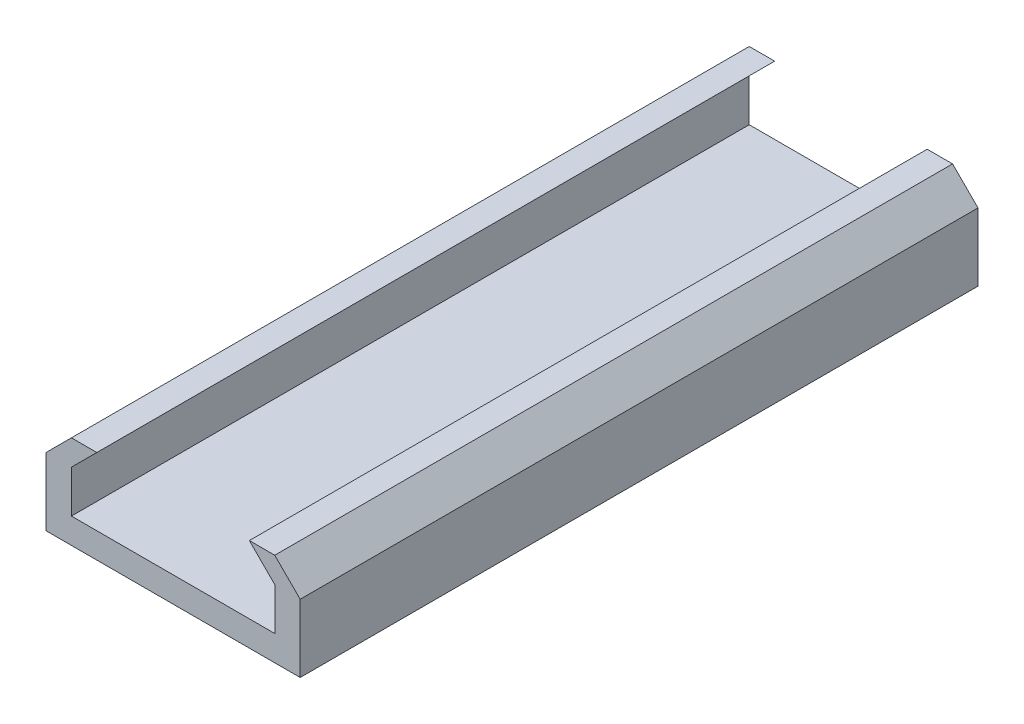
ISO-10303-21;
HEADER;
FILE_DESCRIPTION(('STEP AP214'),'2;1');
FILE_NAME('part.step','',(''),(''),'','','');
FILE_SCHEMA(('AUTOMOTIVE_DESIGN { 1 0 10303 214 1 1 1 1 }'));
ENDSEC;
DATA;
#1=APPLICATION_CONTEXT('core data for automotive mechanical design processes');
#2=APPLICATION_PROTOCOL_DEFINITION('international standard','automotive_design',2000,#1);
#3=PRODUCT_CONTEXT('',#1,'mechanical');
#4=PRODUCT('Part','Part','',(#3));
#5=PRODUCT_RELATED_PRODUCT_CATEGORY('part','',(#4));
#6=PRODUCT_DEFINITION_FORMATION('','',#4);
#7=PRODUCT_DEFINITION_CONTEXT('part definition',#1,'design');
#8=PRODUCT_DEFINITION('design','',#6,#7);
#9=PRODUCT_DEFINITION_SHAPE('','',#8);
#10=(LENGTH_UNIT() NAMED_UNIT(*) SI_UNIT(.MILLI.,.METRE.));
#11=(NAMED_UNIT(*) PLANE_ANGLE_UNIT() SI_UNIT($,.RADIAN.));
#12=(NAMED_UNIT(*) SI_UNIT($,.STERADIAN.) SOLID_ANGLE_UNIT());
#13=UNCERTAINTY_MEASURE_WITH_UNIT(LENGTH_MEASURE(1.E-05),#10,'distance_accuracy_value','');
#14=(GEOMETRIC_REPRESENTATION_CONTEXT(3) GLOBAL_UNCERTAINTY_ASSIGNED_CONTEXT((#13)) GLOBAL_UNIT_ASSIGNED_CONTEXT((#10,
#11,#12)) REPRESENTATION_CONTEXT('',''));
#15=CARTESIAN_POINT('',(0.,0.,0.));
#16=DIRECTION('',(0.,0.,1.));
#17=DIRECTION('',(1.,0.,0.));
#18=AXIS2_PLACEMENT_3D('',#15,#16,#17);
#19=CARTESIAN_POINT('',(-47.625,-9.525,-254.));
#20=DIRECTION('',(-1.,0.,0.));
#21=DIRECTION('',(0.,-1.,0.));
#22=AXIS2_PLACEMENT_3D('',#19,#20,#21);
#23=PLANE('',#22);
#24=DIRECTION('',(0.,-1.,0.));
#25=VECTOR('',#24,1.);
#26=CARTESIAN_POINT('',(-47.625,-9.525,0.));
#27=LINE('',#26,#25);
#28=CARTESIAN_POINT('',(-47.625,15.875,0.));
#29=VERTEX_POINT('',#28);
#30=CARTESIAN_POINT('',(-47.625,-9.525,0.));
#31=VERTEX_POINT('',#30);
#32=EDGE_CURVE('E153',#29,#31,#27,.T.);
#33=ORIENTED_EDGE('',*,*,#32,.F.);
#34=DIRECTION('',(0.,0.,1.));
#35=VECTOR('',#34,1.);
#36=CARTESIAN_POINT('',(-47.625,15.875,-254.));
#37=LINE('',#36,#35);
#38=CARTESIAN_POINT('',(-47.625,15.875,-254.));
#39=VERTEX_POINT('',#38);
#40=EDGE_CURVE('E11',#39,#29,#37,.T.);
#41=ORIENTED_EDGE('',*,*,#40,.F.);
#42=DIRECTION('',(0.,-1.,0.));
#43=VECTOR('',#42,1.);
#44=CARTESIAN_POINT('',(-47.625,-9.525,-254.));
#45=LINE('',#44,#43);
#46=CARTESIAN_POINT('',(-47.625,-9.525,-254.));
#47=VERTEX_POINT('',#46);
#48=EDGE_CURVE('E185',#39,#47,#45,.T.);
#49=ORIENTED_EDGE('',*,*,#48,.T.);
#50=DIRECTION('',(0.,0.,1.));
#51=VECTOR('',#50,1.);
#52=CARTESIAN_POINT('',(-47.625,-9.525,-254.));
#53=LINE('',#52,#51);
#54=EDGE_CURVE('E35',#47,#31,#53,.T.);
#55=ORIENTED_EDGE('',*,*,#54,.T.);
#56=EDGE_LOOP('',(#33,#41,#49,#55));
#57=FACE_BOUND('',#56,.T.);
#58=ADVANCED_FACE('F32',(#57),#23,.T.);
#59=CARTESIAN_POINT('',(-47.625,15.875,-254.));
#60=DIRECTION('',(-0.707106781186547,0.707106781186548,0.));
#61=DIRECTION('',(-0.707106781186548,-0.707106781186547,0.));
#62=AXIS2_PLACEMENT_3D('',#59,#60,#61);
#63=PLANE('',#62);
#64=DIRECTION('',(-0.707106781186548,-0.707106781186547,0.));
#65=VECTOR('',#64,1.);
#66=CARTESIAN_POINT('',(-47.625,15.875,0.));
#67=LINE('',#66,#65);
#68=CARTESIAN_POINT('',(-38.1,25.4,0.));
#69=VERTEX_POINT('',#68);
#70=EDGE_CURVE('E183',#69,#29,#67,.T.);
#71=ORIENTED_EDGE('',*,*,#70,.F.);
#72=DIRECTION('',(0.,0.,1.));
#73=VECTOR('',#72,1.);
#74=CARTESIAN_POINT('',(-38.1,25.4,-254.));
#75=LINE('',#74,#73);
#76=CARTESIAN_POINT('',(-38.1,25.4,-254.));
#77=VERTEX_POINT('',#76);
#78=EDGE_CURVE('E41',#77,#69,#75,.T.);
#79=ORIENTED_EDGE('',*,*,#78,.F.);
#80=DIRECTION('',(-0.707106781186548,-0.707106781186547,0.));
#81=VECTOR('',#80,1.);
#82=CARTESIAN_POINT('',(-47.625,15.875,-254.));
#83=LINE('',#82,#81);
#84=EDGE_CURVE('E143',#77,#39,#83,.T.);
#85=ORIENTED_EDGE('',*,*,#84,.T.);
#86=ORIENTED_EDGE('',*,*,#40,.T.);
#87=EDGE_LOOP('',(#71,#79,#85,#86));
#88=FACE_BOUND('',#87,.T.);
#89=ADVANCED_FACE('F205',(#88),#63,.T.);
#90=CARTESIAN_POINT('',(-38.1,25.4,-254.));
#91=DIRECTION('',(0.,1.,0.));
#92=DIRECTION('',(0.,0.,1.));
#93=AXIS2_PLACEMENT_3D('',#90,#91,#92);
#94=PLANE('',#93);
#95=DIRECTION('',(-1.,0.,0.));
#96=VECTOR('',#95,1.);
#97=CARTESIAN_POINT('',(-38.1,25.4,0.));
#98=LINE('',#97,#96);
#99=CARTESIAN_POINT('',(-28.575,25.4,0.));
#100=VERTEX_POINT('',#99);
#101=EDGE_CURVE('E130',#100,#69,#98,.T.);
#102=ORIENTED_EDGE('',*,*,#101,.F.);
#103=DIRECTION('',(0.,0.,1.));
#104=VECTOR('',#103,1.);
#105=CARTESIAN_POINT('',(-28.575,25.4,-254.));
#106=LINE('',#105,#104);
#107=CARTESIAN_POINT('',(-28.575,25.4,-254.));
#108=VERTEX_POINT('',#107);
#109=EDGE_CURVE('E125',#108,#100,#106,.T.);
#110=ORIENTED_EDGE('',*,*,#109,.F.);
#111=DIRECTION('',(-1.,0.,0.));
#112=VECTOR('',#111,1.);
#113=CARTESIAN_POINT('',(-38.1,25.4,-254.));
#114=LINE('',#113,#112);
#115=EDGE_CURVE('E128',#108,#77,#114,.T.);
#116=ORIENTED_EDGE('',*,*,#115,.T.);
#117=ORIENTED_EDGE('',*,*,#78,.T.);
#118=EDGE_LOOP('',(#102,#110,#116,#117));
#119=FACE_BOUND('',#118,.T.);
#120=ADVANCED_FACE('F127',(#119),#94,.T.);
#121=CARTESIAN_POINT('',(-28.575,25.4,-254.));
#122=DIRECTION('',(0.707106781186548,-0.707106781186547,0.));
#123=DIRECTION('',(0.707106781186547,0.707106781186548,0.));
#124=AXIS2_PLACEMENT_3D('',#121,#122,#123);
#125=PLANE('',#124);
#126=DIRECTION('',(0.707106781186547,0.707106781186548,0.));
#127=VECTOR('',#126,1.);
#128=CARTESIAN_POINT('',(-28.575,25.4,0.));
#129=LINE('',#128,#127);
#130=CARTESIAN_POINT('',(-38.1,15.875,0.));
#131=VERTEX_POINT('',#130);
#132=EDGE_CURVE('E180',#131,#100,#129,.T.);
#133=ORIENTED_EDGE('',*,*,#132,.F.);
#134=DIRECTION('',(0.,0.,1.));
#135=VECTOR('',#134,1.);
#136=CARTESIAN_POINT('',(-38.1,15.875,-254.));
#137=LINE('',#136,#135);
#138=CARTESIAN_POINT('',(-38.1,15.875,-254.));
#139=VERTEX_POINT('',#138);
#140=EDGE_CURVE('E135',#139,#131,#137,.T.);
#141=ORIENTED_EDGE('',*,*,#140,.F.);
#142=DIRECTION('',(0.707106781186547,0.707106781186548,0.));
#143=VECTOR('',#142,1.);
#144=CARTESIAN_POINT('',(-28.575,25.4,-254.));
#145=LINE('',#144,#143);
#146=EDGE_CURVE('E141',#139,#108,#145,.T.);
#147=ORIENTED_EDGE('',*,*,#146,.T.);
#148=ORIENTED_EDGE('',*,*,#109,.T.);
#149=EDGE_LOOP('',(#133,#141,#147,#148));
#150=FACE_BOUND('',#149,.T.);
#151=ADVANCED_FACE('F145',(#150),#125,.T.);
#152=CARTESIAN_POINT('',(-38.1,15.875,-254.));
#153=DIRECTION('',(1.,0.,0.));
#154=DIRECTION('',(0.,1.,0.));
#155=AXIS2_PLACEMENT_3D('',#152,#153,#154);
#156=PLANE('',#155);
#157=DIRECTION('',(0.,1.,0.));
#158=VECTOR('',#157,1.);
#159=CARTESIAN_POINT('',(-38.1,15.875,0.));
#160=LINE('',#159,#158);
#161=CARTESIAN_POINT('',(-38.1,0.,0.));
#162=VERTEX_POINT('',#161);
#163=EDGE_CURVE('E177',#162,#131,#160,.T.);
#164=ORIENTED_EDGE('',*,*,#163,.F.);
#165=DIRECTION('',(0.,0.,1.));
#166=VECTOR('',#165,1.);
#167=CARTESIAN_POINT('',(-38.1,0.,-254.));
#168=LINE('',#167,#166);
#169=CARTESIAN_POINT('',(-38.1,0.,-254.));
#170=VERTEX_POINT('',#169);
#171=EDGE_CURVE('E189',#170,#162,#168,.T.);
#172=ORIENTED_EDGE('',*,*,#171,.F.);
#173=DIRECTION('',(0.,1.,0.));
#174=VECTOR('',#173,1.);
#175=CARTESIAN_POINT('',(-38.1,15.875,-254.));
#176=LINE('',#175,#174);
#177=EDGE_CURVE('E146',#170,#139,#176,.T.);
#178=ORIENTED_EDGE('',*,*,#177,.T.);
#179=ORIENTED_EDGE('',*,*,#140,.T.);
#180=EDGE_LOOP('',(#164,#172,#178,#179));
#181=FACE_BOUND('',#180,.T.);
#182=ADVANCED_FACE('F218',(#181),#156,.T.);
#183=CARTESIAN_POINT('',(-38.1,0.,-254.));
#184=DIRECTION('',(0.,1.,0.));
#185=DIRECTION('',(0.,0.,1.));
#186=AXIS2_PLACEMENT_3D('',#183,#184,#185);
#187=PLANE('',#186);
#188=DIRECTION('',(-1.,0.,0.));
#189=VECTOR('',#188,1.);
#190=CARTESIAN_POINT('',(-38.1,0.,0.));
#191=LINE('',#190,#189);
#192=CARTESIAN_POINT('',(38.1,0.,0.));
#193=VERTEX_POINT('',#192);
#194=EDGE_CURVE('E174',#193,#162,#191,.T.);
#195=ORIENTED_EDGE('',*,*,#194,.F.);
#196=DIRECTION('',(0.,0.,1.));
#197=VECTOR('',#196,1.);
#198=CARTESIAN_POINT('',(38.1,0.,-254.));
#199=LINE('',#198,#197);
#200=CARTESIAN_POINT('',(38.1,0.,-254.));
#201=VERTEX_POINT('',#200);
#202=EDGE_CURVE('E191',#201,#193,#199,.T.);
#203=ORIENTED_EDGE('',*,*,#202,.F.);
#204=DIRECTION('',(-1.,0.,0.));
#205=VECTOR('',#204,1.);
#206=CARTESIAN_POINT('',(-38.1,0.,-254.));
#207=LINE('',#206,#205);
#208=EDGE_CURVE('E148',#201,#170,#207,.T.);
#209=ORIENTED_EDGE('',*,*,#208,.T.);
#210=ORIENTED_EDGE('',*,*,#171,.T.);
#211=EDGE_LOOP('',(#195,#203,#209,#210));
#212=FACE_BOUND('',#211,.T.);
#213=ADVANCED_FACE('F221',(#212),#187,.T.);
#214=CARTESIAN_POINT('',(38.1,0.,-254.));
#215=DIRECTION('',(-1.,0.,0.));
#216=DIRECTION('',(0.,-1.,0.));
#217=AXIS2_PLACEMENT_3D('',#214,#215,#216);
#218=PLANE('',#217);
#219=DIRECTION('',(0.,-1.,0.));
#220=VECTOR('',#219,1.);
#221=CARTESIAN_POINT('',(38.1,0.,0.));
#222=LINE('',#221,#220);
#223=CARTESIAN_POINT('',(38.1,15.875,0.));
#224=VERTEX_POINT('',#223);
#225=EDGE_CURVE('E171',#224,#193,#222,.T.);
#226=ORIENTED_EDGE('',*,*,#225,.F.);
#227=DIRECTION('',(0.,0.,1.));
#228=VECTOR('',#227,1.);
#229=CARTESIAN_POINT('',(38.1,15.875,-254.));
#230=LINE('',#229,#228);
#231=CARTESIAN_POINT('',(38.1,15.875,-254.));
#232=VERTEX_POINT('',#231);
#233=EDGE_CURVE('E193',#232,#224,#230,.T.);
#234=ORIENTED_EDGE('',*,*,#233,.F.);
#235=DIRECTION('',(0.,-1.,0.));
#236=VECTOR('',#235,1.);
#237=CARTESIAN_POINT('',(38.1,0.,-254.));
#238=LINE('',#237,#236);
#239=EDGE_CURVE('E347',#232,#201,#238,.T.);
#240=ORIENTED_EDGE('',*,*,#239,.T.);
#241=ORIENTED_EDGE('',*,*,#202,.T.);
#242=EDGE_LOOP('',(#226,#234,#240,#241));
#243=FACE_BOUND('',#242,.T.);
#244=ADVANCED_FACE('F225',(#243),#218,.T.);
#245=CARTESIAN_POINT('',(38.1,15.875,-254.));
#246=DIRECTION('',(-0.707106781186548,-0.707106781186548,0.));
#247=DIRECTION('',(0.707106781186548,-0.707106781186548,0.));
#248=AXIS2_PLACEMENT_3D('',#245,#246,#247);
#249=PLANE('',#248);
#250=DIRECTION('',(0.707106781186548,-0.707106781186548,0.));
#251=VECTOR('',#250,1.);
#252=CARTESIAN_POINT('',(38.1,15.875,0.));
#253=LINE('',#252,#251);
#254=CARTESIAN_POINT('',(28.575,25.4,0.));
#255=VERTEX_POINT('',#254);
#256=EDGE_CURVE('E168',#255,#224,#253,.T.);
#257=ORIENTED_EDGE('',*,*,#256,.F.);
#258=DIRECTION('',(0.,0.,1.));
#259=VECTOR('',#258,1.);
#260=CARTESIAN_POINT('',(28.575,25.4,-254.));
#261=LINE('',#260,#259);
#262=CARTESIAN_POINT('',(28.575,25.4,-254.));
#263=VERTEX_POINT('',#262);
#264=EDGE_CURVE('E195',#263,#255,#261,.T.);
#265=ORIENTED_EDGE('',*,*,#264,.F.);
#266=DIRECTION('',(0.707106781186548,-0.707106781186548,0.));
#267=VECTOR('',#266,1.);
#268=CARTESIAN_POINT('',(38.1,15.875,-254.));
#269=LINE('',#268,#267);
#270=EDGE_CURVE('E351',#263,#232,#269,.T.);
#271=ORIENTED_EDGE('',*,*,#270,.T.);
#272=ORIENTED_EDGE('',*,*,#233,.T.);
#273=EDGE_LOOP('',(#257,#265,#271,#272));
#274=FACE_BOUND('',#273,.T.);
#275=ADVANCED_FACE('F229',(#274),#249,.T.);
#276=CARTESIAN_POINT('',(28.575,25.4,-254.));
#277=DIRECTION('',(0.,1.,0.));
#278=DIRECTION('',(0.,0.,1.));
#279=AXIS2_PLACEMENT_3D('',#276,#277,#278);
#280=PLANE('',#279);
#281=DIRECTION('',(-1.,0.,0.));
#282=VECTOR('',#281,1.);
#283=CARTESIAN_POINT('',(28.575,25.4,0.));
#284=LINE('',#283,#282);
#285=CARTESIAN_POINT('',(38.1,25.4,0.));
#286=VERTEX_POINT('',#285);
#287=EDGE_CURVE('E165',#286,#255,#284,.T.);
#288=ORIENTED_EDGE('',*,*,#287,.F.);
#289=DIRECTION('',(0.,0.,1.));
#290=VECTOR('',#289,1.);
#291=CARTESIAN_POINT('',(38.1,25.4,-254.));
#292=LINE('',#291,#290);
#293=CARTESIAN_POINT('',(38.1,25.4,-254.));
#294=VERTEX_POINT('',#293);
#295=EDGE_CURVE('E197',#294,#286,#292,.T.);
#296=ORIENTED_EDGE('',*,*,#295,.F.);
#297=DIRECTION('',(-1.,0.,0.));
#298=VECTOR('',#297,1.);
#299=CARTESIAN_POINT('',(28.575,25.4,-254.));
#300=LINE('',#299,#298);
#301=EDGE_CURVE('E340',#294,#263,#300,.T.);
#302=ORIENTED_EDGE('',*,*,#301,.T.);
#303=ORIENTED_EDGE('',*,*,#264,.T.);
#304=EDGE_LOOP('',(#288,#296,#302,#303));
#305=FACE_BOUND('',#304,.T.);
#306=ADVANCED_FACE('F233',(#305),#280,.T.);
#307=CARTESIAN_POINT('',(38.1,25.4,-254.));
#308=DIRECTION('',(0.707106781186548,0.707106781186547,0.));
#309=DIRECTION('',(-0.707106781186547,0.707106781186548,0.));
#310=AXIS2_PLACEMENT_3D('',#307,#308,#309);
#311=PLANE('',#310);
#312=DIRECTION('',(-0.707106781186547,0.707106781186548,0.));
#313=VECTOR('',#312,1.);
#314=CARTESIAN_POINT('',(38.1,25.4,0.));
#315=LINE('',#314,#313);
#316=CARTESIAN_POINT('',(47.625,15.875,0.));
#317=VERTEX_POINT('',#316);
#318=EDGE_CURVE('E162',#317,#286,#315,.T.);
#319=ORIENTED_EDGE('',*,*,#318,.F.);
#320=DIRECTION('',(0.,0.,1.));
#321=VECTOR('',#320,1.);
#322=CARTESIAN_POINT('',(47.625,15.875,-254.));
#323=LINE('',#322,#321);
#324=CARTESIAN_POINT('',(47.625,15.875,-254.));
#325=VERTEX_POINT('',#324);
#326=EDGE_CURVE('E199',#325,#317,#323,.T.);
#327=ORIENTED_EDGE('',*,*,#326,.F.);
#328=DIRECTION('',(-0.707106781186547,0.707106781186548,0.));
#329=VECTOR('',#328,1.);
#330=CARTESIAN_POINT('',(38.1,25.4,-254.));
#331=LINE('',#330,#329);
#332=EDGE_CURVE('E336',#325,#294,#331,.T.);
#333=ORIENTED_EDGE('',*,*,#332,.T.);
#334=ORIENTED_EDGE('',*,*,#295,.T.);
#335=EDGE_LOOP('',(#319,#327,#333,#334));
#336=FACE_BOUND('',#335,.T.);
#337=ADVANCED_FACE('F237',(#336),#311,.T.);
#338=CARTESIAN_POINT('',(47.625,-9.525,-254.));
#339=DIRECTION('',(1.,0.,0.));
#340=DIRECTION('',(0.,0.,-1.));
#341=AXIS2_PLACEMENT_3D('',#338,#339,#340);
#342=PLANE('',#341);
#343=DIRECTION('',(0.,1.,0.));
#344=VECTOR('',#343,1.);
#345=CARTESIAN_POINT('',(47.625,-9.525,0.));
#346=LINE('',#345,#344);
#347=CARTESIAN_POINT('',(47.625,-9.525,0.));
#348=VERTEX_POINT('',#347);
#349=EDGE_CURVE('E159',#348,#317,#346,.T.);
#350=ORIENTED_EDGE('',*,*,#349,.F.);
#351=DIRECTION('',(0.,0.,1.));
#352=VECTOR('',#351,1.);
#353=CARTESIAN_POINT('',(47.625,-9.525,-254.));
#354=LINE('',#353,#352);
#355=CARTESIAN_POINT('',(47.625,-9.525,-254.));
#356=VERTEX_POINT('',#355);
#357=EDGE_CURVE('E200',#356,#348,#354,.T.);
#358=ORIENTED_EDGE('',*,*,#357,.F.);
#359=DIRECTION('',(0.,1.,0.));
#360=VECTOR('',#359,1.);
#361=CARTESIAN_POINT('',(47.625,-9.525,-254.));
#362=LINE('',#361,#360);
#363=EDGE_CURVE('E357',#356,#325,#362,.T.);
#364=ORIENTED_EDGE('',*,*,#363,.T.);
#365=ORIENTED_EDGE('',*,*,#326,.T.);
#366=EDGE_LOOP('',(#350,#358,#364,#365));
#367=FACE_BOUND('',#366,.T.);
#368=ADVANCED_FACE('F241',(#367),#342,.T.);
#369=CARTESIAN_POINT('',(-47.625,-9.525,-254.));
#370=DIRECTION('',(0.,-1.,0.));
#371=DIRECTION('',(1.,0.,0.));
#372=AXIS2_PLACEMENT_3D('',#369,#370,#371);
#373=PLANE('',#372);
#374=DIRECTION('',(1.,0.,0.));
#375=VECTOR('',#374,1.);
#376=CARTESIAN_POINT('',(-47.625,-9.525,0.));
#377=LINE('',#376,#375);
#378=EDGE_CURVE('E156',#31,#348,#377,.T.);
#379=ORIENTED_EDGE('',*,*,#378,.F.);
#380=ORIENTED_EDGE('',*,*,#54,.F.);
#381=DIRECTION('',(1.,0.,0.));
#382=VECTOR('',#381,1.);
#383=CARTESIAN_POINT('',(-47.625,-9.525,-254.));
#384=LINE('',#383,#382);
#385=EDGE_CURVE('E359',#47,#356,#384,.T.);
#386=ORIENTED_EDGE('',*,*,#385,.T.);
#387=ORIENTED_EDGE('',*,*,#357,.T.);
#388=EDGE_LOOP('',(#379,#380,#386,#387));
#389=FACE_BOUND('',#388,.T.);
#390=ADVANCED_FACE('F202',(#389),#373,.T.);
#391=CARTESIAN_POINT('',(-47.625,0.,-254.));
#392=DIRECTION('',(0.,0.,-1.));
#393=DIRECTION('',(-1.,0.,0.));
#394=AXIS2_PLACEMENT_3D('',#391,#392,#393);
#395=PLANE('',#394);
#396=ORIENTED_EDGE('',*,*,#48,.F.);
#397=ORIENTED_EDGE('',*,*,#84,.F.);
#398=ORIENTED_EDGE('',*,*,#115,.F.);
#399=ORIENTED_EDGE('',*,*,#146,.F.);
#400=ORIENTED_EDGE('',*,*,#177,.F.);
#401=ORIENTED_EDGE('',*,*,#208,.F.);
#402=ORIENTED_EDGE('',*,*,#239,.F.);
#403=ORIENTED_EDGE('',*,*,#270,.F.);
#404=ORIENTED_EDGE('',*,*,#301,.F.);
#405=ORIENTED_EDGE('',*,*,#332,.F.);
#406=ORIENTED_EDGE('',*,*,#363,.F.);
#407=ORIENTED_EDGE('',*,*,#385,.F.);
#408=EDGE_LOOP('',(#396,#397,#398,#399,#400,#401,#402,#403,#404,#405,#406,#407));
#409=FACE_BOUND('',#408,.T.);
#410=ADVANCED_FACE('F139',(#409),#395,.T.);
#411=CARTESIAN_POINT('',(-47.625,0.,0.));
#412=DIRECTION('',(0.,0.,-1.));
#413=DIRECTION('',(-1.,0.,0.));
#414=AXIS2_PLACEMENT_3D('',#411,#412,#413);
#415=PLANE('',#414);
#416=ORIENTED_EDGE('',*,*,#32,.T.);
#417=ORIENTED_EDGE('',*,*,#378,.T.);
#418=ORIENTED_EDGE('',*,*,#349,.T.);
#419=ORIENTED_EDGE('',*,*,#318,.T.);
#420=ORIENTED_EDGE('',*,*,#287,.T.);
#421=ORIENTED_EDGE('',*,*,#256,.T.);
#422=ORIENTED_EDGE('',*,*,#225,.T.);
#423=ORIENTED_EDGE('',*,*,#194,.T.);
#424=ORIENTED_EDGE('',*,*,#163,.T.);
#425=ORIENTED_EDGE('',*,*,#132,.T.);
#426=ORIENTED_EDGE('',*,*,#101,.T.);
#427=ORIENTED_EDGE('',*,*,#70,.T.);
#428=EDGE_LOOP('',(#416,#417,#418,#419,#420,#421,#422,#423,#424,#425,#426,#427));
#429=FACE_BOUND('',#428,.T.);
#430=ADVANCED_FACE('F204',(#429),#415,.F.);
#431=CLOSED_SHELL('',(#58,#89,#120,#151,#182,#213,#244,#275,#306,#337,#368,#390,#410,#430));
#432=MANIFOLD_SOLID_BREP('B2',#431);
#433=ADVANCED_BREP_SHAPE_REPRESENTATION('',(#18,#432),#14);
#434=SHAPE_DEFINITION_REPRESENTATION(#9,#433);
ENDSEC;
END-ISO-10303-21;
